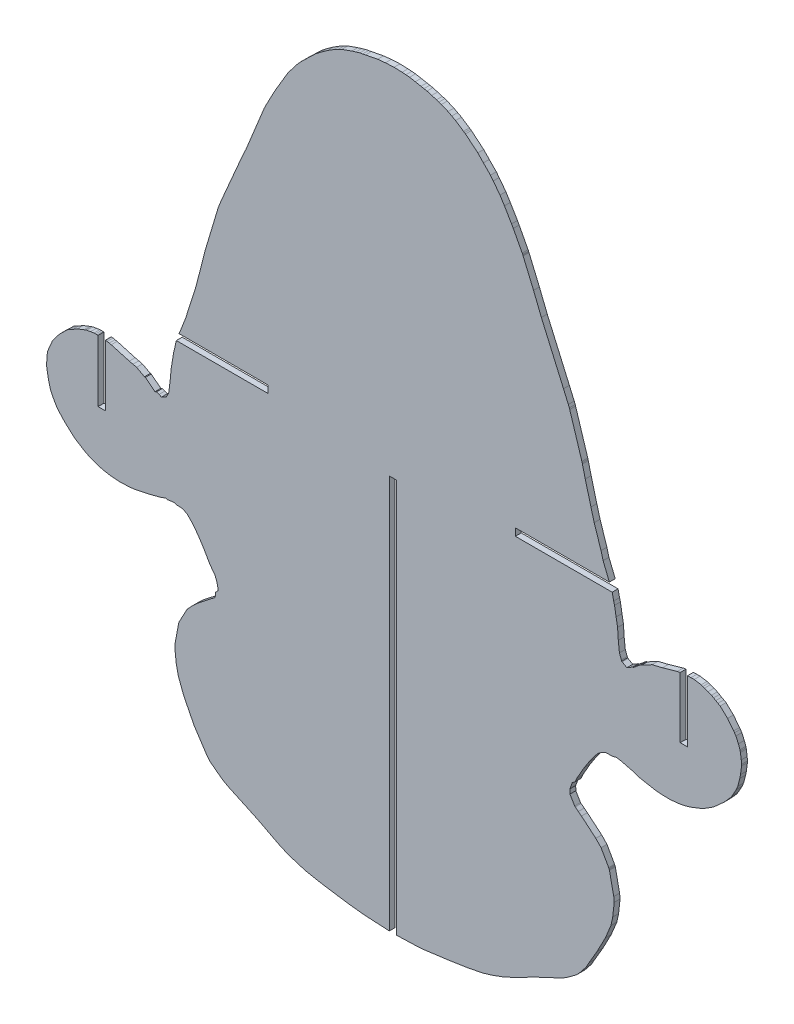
from build123d import *

# Parameters (mm, degrees)
EXTRUDE_1_DEPTH = 2


with BuildPart() as part:
    # Model → Extrude 1 (new body)
    with BuildSketch(Plane.XY):
        Polygon((-4539.2097, -790.8578), (-4543.2316, -789.8734), (-4543.8733, -789.7726), (-4544.515, -789.6715), (-4545.1657, -789.8214), (-4545.8165, -789.9716), (-4546.9584, -790.0294), (-4548.1003, -790.0876), (-4548.5258, -790.1515), (-4550.4754, -791.2985), (-4551.1526, -792.0378), (-4551.8298, -792.7768), (-4553.8655, -795.6481), (-4555.4986, -798.1437), (-4557.9984, -802.5048), (-4558.2972, -803.1813), (-4558.596, -803.8581), (-4559.0841, -804.2336), (-4559.5722, -804.6093), (-4560.4169, -806.8874), (-4560.3701, -808.4098), (-4558.763, -811.1066), (-4558.5805, -811.2975), (-4557.519, -812.1125), (-4556.4575, -812.9272), (-4551.5788, -817.047), (-4549.7786, -818.9108), (-4547.1777, -823.4889), (-4547.1041, -823.6569), (-4547.0306, -823.8246), (-4547.0128, -823.8654), (-4546.9951, -823.9059), (-4546.959, -824.0324), (-4546.923, -824.1591), (-4545.4544, -831.1642), (-4545.301, -832.8083), (-4545.8082, -837.4057), (-4546.3854, -840.1383), (-4548.3282, -844.8258), (-4551.1271, -850.1918), (-4553.9501, -855.0246), (-4554.9565, -856.8376), (-4557.1746, -859.6056), (-4558.1649, -860.6364), (-4561.2219, -862.8742), (-4562.2226, -863.5182), (-4563.5665, -864.2628), (-4572.4068, -868.4179), (-4579.4051, -872.0412), (-4583.5673, -873.8878), (-4586.6701, -875.0216), (-4590.0086, -876.0465), (-4595.1373, -877.0517), (-4600.9925, -877.9701), (-4609.15, -879.049), (-4610.9169, -879.2638), (-4612.9695, -879.3737), (-4619.0279, -879.5702), (-4619.3456, -879.5934), (-4619.4133, -879.5984), (-4619.4133, -745.3183), (-4619.6634, -745.3183), (-4621.6634, -745.3183), (-4621.9133, -745.3183), (-4621.9133, -879.5572), (-4630.3521, -879.0929), (-4635.1501, -878.5636), (-4637.3957, -878.2477), (-4639.6413, -877.932), (-4645.7078, -876.9806), (-4650.7294, -875.9928), (-4654.4396, -874.8361), (-4655.8, -874.3561), (-4657.1605, -873.8764), (-4658.3128, -873.3708), (-4659.4651, -872.8654), (-4666.7346, -869.081), (-4676.6673, -864.4753), (-4678.3129, -863.5622), (-4679.6122, -862.6881), (-4683.022, -860.0951), (-4683.4616, -859.571), (-4683.9012, -859.047), (-4688.2785, -852.4176), (-4689.7039, -849.6376), (-4692.0418, -844.9523), (-4693.7796, -840.3092), (-4694.4931, -836.9772), (-4694.973, -832.7043), (-4694.8629, -831.0016), (-4693.6779, -824.6508), (-4693.6454, -824.5343), (-4693.613, -824.4176), (-4693.5715, -824.3302), (-4693.4359, -823.9987), (-4691.07, -819.6042), (-4690.8127, -819.0783), (-4690.1152, -818.3302), (-4689.4178, -817.5819), (-4687.2056, -815.477), (-4681.2269, -810.8229), (-4681.1719, -809.2943), (-4680.7441, -808.8463), (-4680.3163, -808.3986), (-4680.2519, -808.1667), (-4680.1874, -807.9345), (-4680.7082, -805.8615), (-4681.2849, -804.2648), (-4682.957, -802.0836), (-4685.1479, -798.2858), (-4687.1816, -795.1496), (-4689.3422, -792.4276), (-4690.0955, -791.6798), (-4690.8487, -790.9323), (-4691.6077, -790.5685), (-4692.3666, -790.205), (-4694.4406, -790.0648), (-4695.4153, -789.7733), (-4697.5311, -790.1068), (-4698.1468, -789.9189), (-4699.4107, -790.4555), (-4701.2761, -790.946), (-4703.1414, -791.4367), (-4706.1068, -792.0744), (-4708.9947, -792.6867), (-4711.1729, -792.8605), (-4714.1107, -792.9596), (-4716.4146, -792.7702), (-4719.1192, -792.3566), (-4720.6899, -791.9245), (-4722.1376, -791.4088), (-4723.5853, -790.8935), (-4724.2835, -790.5841), (-4724.9818, -790.2751), (-4725.7415, -789.8307), (-4726.5013, -789.3861), (-4729.0214, -787.7963), (-4730.4988, -786.5092), (-4732.5521, -784.6322), (-4734.8056, -782.1642), (-4735.1845, -781.6671), (-4735.3141, -781.4503), (-4735.4438, -781.2333), (-4736.9827, -778.4372), (-4737.3951, -777.4088), (-4738.0706, -774.7426), (-4738.3677, -773.1271), (-4738.6981, -770.9513), (-4738.5649, -769.0597), (-4738.3914, -766.9027), (-4738.3635, -766.7851), (-4738.2314, -766.4718), (-4738.0994, -766.1588), (-4736.7261, -762.9198), (-4736.5427, -762.6198), (-4736.3593, -762.32), (-4734.7241, -760.1786), (-4734.2527, -759.6584), (-4733.7813, -759.1378), (-4731.4046, -756.8715), (-4730.5877, -756.4313), (-4729.7708, -755.9909), (-4728.1934, -755.067), (-4725.9476, -754.1979), (-4725.4336, -754.0172), (-4724.9196, -753.8368), (-4723.7178, -753.6364), (-4722.5159, -753.4362), (-4722.0008, -753.4425), (-4721.4857, -753.4486), (-4721.1865, -753.446), (-4721.1372, -753.4455), (-4721.1372, -774.4633), (-4720.8873, -774.4633), (-4718.8873, -774.4633), (-4718.6372, -774.4633), (-4718.6372, -753.6093), (-4718.4631, -753.633), (-4718.039, -753.6903), (-4717.342, -753.8302), (-4716.6451, -753.9704), (-4710.4953, -755.7179), (-4709.2588, -756.0133), (-4708.0223, -756.309), (-4705.3383, -757.7563), (-4705.0314, -757.7939), (-4701.7507, -760.3795), (-4701.2244, -760.151), (-4700.371, -760.4977), (-4699.5176, -760.8441), (-4698.6953, -760.3864), (-4697.873, -759.9289), (-4697.0792, -758.506), (-4696.5532, -754.2253), (-4696.2469, -750.9357), (-4695.8832, -748.6842), (-4695.3497, -745.4181), (-4695.1386, -744.6628), (-4694.481, -741.6415), (-4663.1755, -741.6415), (-4663.1755, -741.3915), (-4663.1755, -739.3915), (-4663.1755, -739.1415), (-4693.5545, -739.1415), (-4692.8851, -737.5402), (-4691.0186, -732.7296), (-4690.9567, -732.5036), (-4690.8948, -732.2777), (-4690.855, -732.0988), (-4690.8152, -731.9196), (-4688.0716, -723.3866), (-4687.0738, -719.6225), (-4685.0301, -711.6564), (-4684.7387, -710.4464), (-4684.7178, -710.3693), (-4684.697, -710.2919), (-4680.4953, -696.2599), (-4680.1295, -695.1012), (-4679.2088, -692.7917), (-4676.2448, -685.8708), (-4672.0536, -676.1718), (-4670.7458, -673.3644), (-4665.4769, -660.4608), (-4664.9175, -659.0468), (-4664.5051, -658.0834), (-4664.0979, -657.2702), (-4663.6907, -656.4572), (-4661.2191, -651.7519), (-4660.931, -651.235), (-4660.643, -650.7184), (-4656.9944, -644.5692), (-4656.6659, -644.0338), (-4656.3373, -643.4987), (-4653.4802, -639.7834), (-4652.3814, -638.5045), (-4650.8339, -636.9753), (-4646.9528, -633.2533), (-4645.3713, -632.0297), (-4642.9376, -630.2846), (-4640.7177, -628.8857), (-4639.3935, -628.2116), (-4638.0693, -627.5378), (-4634.6475, -626.32), (-4633.3049, -625.9152), (-4631.9623, -625.5107), (-4630.9839, -625.3293), (-4630.0054, -625.1476), (-4625.8974, -624.3556), (-4623.2484, -624.0773), (-4620.2838, -623.9186), (-4617.5554, -624.0158), (-4616.2806, -624.1208), (-4615.0059, -624.226), (-4613.0689, -624.5822), (-4611.1319, -624.9386), (-4610.1076, -625.1349), (-4609.0833, -625.331), (-4607.4709, -625.8097), (-4605.8586, -626.2882), (-4605.0275, -626.5675), (-4604.1964, -626.8471), (-4601.9258, -627.7987), (-4600.6436, -628.4792), (-4599.3614, -629.1598), (-4596.6459, -630.9772), (-4596.3138, -631.2003), (-4595.9818, -631.4237), (-4591.7682, -634.9157), (-4589.8505, -636.9076), (-4587.4677, -639.3385), (-4586.508, -640.5729), (-4584.2145, -643.5766), (-4582.6988, -646.0146), (-4580.27, -650.1003), (-4579.6823, -651.1569), (-4576.6409, -656.9206), (-4576.4949, -657.2243), (-4576.4107, -657.4196), (-4576.3265, -657.6151), (-4572.7773, -665.9823), (-4570.1166, -672.6515), (-4562.5698, -689.8996), (-4560.9267, -693.7157), (-4560.5915, -694.5536), (-4560.455, -694.9774), (-4556.3115, -708.1996), (-4556.2201, -708.549), (-4556.1287, -708.8981), (-4555.1533, -712.8405), (-4553.2255, -720.132), (-4552.1135, -724.193), (-4549.7914, -731.2682), (-4549.0843, -733.9005), (-4546.9446, -739.1415), (-4578.9683, -739.1415), (-4578.9683, -739.3915), (-4578.9683, -741.3915), (-4578.9683, -741.6415), (-4545.9914, -741.6415), (-4545.4682, -744.0055), (-4545.1801, -745.1022), (-4544.6589, -748.2953), (-4544.1451, -751.1015), (-4543.9053, -754.7824), (-4543.5274, -758.3263), (-4542.8559, -760.0824), (-4542.7465, -760.4106), (-4542.6601, -760.4582), (-4542.5737, -760.5055), (-4540.9783, -761.4054), (-4540.0085, -760.8332), (-4539.0388, -760.2607), (-4538.9107, -760.2526), (-4538.7827, -760.2448), (-4536.3211, -758.2455), (-4535.9709, -758.1869), (-4532.3817, -756.2353), (-4528.8261, -755.369), (-4523.8069, -753.9347), (-4522.8151, -753.7336), (-4522.8151, -774.4633), (-4522.5652, -774.4633), (-4520.5652, -774.4633), (-4520.3151, -774.4633), (-4520.3151, -753.4433), (-4519.1618, -753.4425), (-4518.046, -753.4318), (-4515.6766, -753.817), (-4515.0971, -754.0207), (-4514.5176, -754.2245), (-4513.343, -754.6789), (-4512.1683, -755.133), (-4511.4391, -755.5597), (-4510.7099, -755.9867), (-4509.9571, -756.403), (-4509.2043, -756.8195), (-4506.69, -759.1911), (-4504.6193, -761.8947), (-4504.3172, -762.2619), (-4503.8415, -762.9904), (-4502.9807, -764.8888), (-4502.4608, -766.3239), (-4502.377, -766.6999), (-4502.2932, -767.0756), (-4502.0186, -769.1413), (-4501.8937, -770.3595), (-4501.9167, -770.8629), (-4502.2753, -773.6059), (-4502.515, -774.8607), (-4503.2119, -777.5324), (-4503.6933, -778.7189), (-4505.0313, -781.109), (-4505.3769, -781.6935), (-4505.6104, -781.9982), (-4505.8439, -782.3031), (-4507.9595, -784.6256), (-4508.9375, -785.4967), (-4509.9155, -786.3676), (-4510.6556, -787.0382), (-4511.3957, -787.7091), (-4512.4014, -788.3629), (-4513.407, -789.0165), (-4514.8088, -789.8734), (-4516.205, -790.5053), (-4518.9599, -791.5927), (-4520.157, -791.9538), (-4521.3541, -792.3146), (-4523.7796, -792.7262), (-4525.0322, -792.8351), (-4526.2847, -792.9438), (-4527.5797, -792.9191), (-4528.8747, -792.8947), (-4529.8737, -792.8336), (-4530.8727, -792.7729), (-4536.1199, -791.8056), (-4536.6108, -791.7123), align=None)
    extrude(amount=EXTRUDE_1_DEPTH)


solid = part.part
